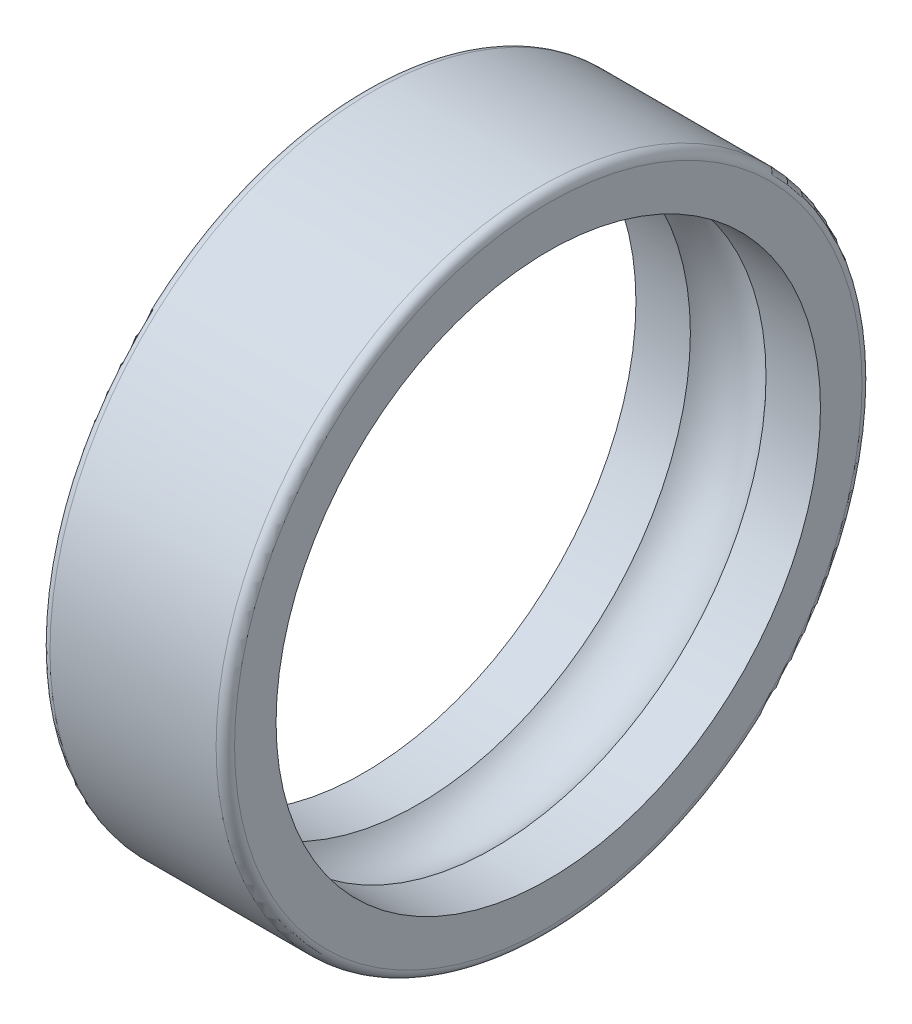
from build123d import *


with BuildPart() as part:
    # Esquisse1 → Base-R_volution (revolve)
    with BuildSketch(Plane(origin=(0, 0, 0), x_dir=(1, 0, 0), z_dir=(0, 1, 0)), mode=Mode.PRIVATE) as base_r_volution_sk:
        with BuildLine():
            Line((0, 20.4), (0, 17.7))
            Line((0, 17.7), (3.540325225, 17.7))
            ThreePointArc((3.540325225, 17.7), (6, 18.8), (8.459674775, 17.7))
            Line((8.459674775, 17.7), (12, 17.7))
            Line((12, 17.7), (12, 20.4))
            ThreePointArc((12, 20.4), (11.824264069, 20.824264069), (11.4, 21))
            Line((11.4, 21), (0.6, 21))
            ThreePointArc((0.6, 21), (0.175735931, 20.824264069), (0, 20.4))
        make_face()
    revolve(base_r_volution_sk.sketch.rotate(Axis((0, 0, 0), (1, 0, 0)), 180), axis=Axis((0, 0, 0), (1, 0, 0)))


solid = part.part
